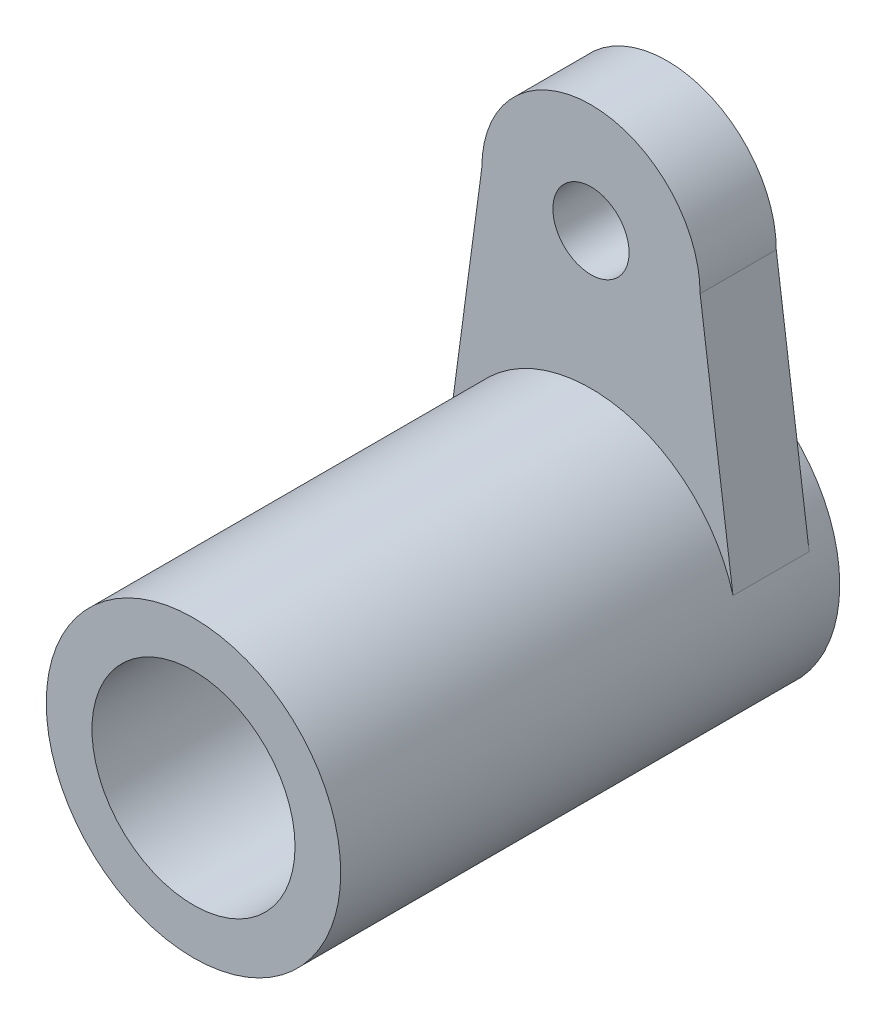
ISO-10303-21;
HEADER;
FILE_DESCRIPTION(('STEP AP214'),'2;1');
FILE_NAME('part.step','',(''),(''),'','','');
FILE_SCHEMA(('AUTOMOTIVE_DESIGN { 1 0 10303 214 1 1 1 1 }'));
ENDSEC;
DATA;
#1=APPLICATION_CONTEXT('core data for automotive mechanical design processes');
#2=APPLICATION_PROTOCOL_DEFINITION('international standard','automotive_design',2000,#1);
#3=PRODUCT_CONTEXT('',#1,'mechanical');
#4=PRODUCT('Part','Part','',(#3));
#5=PRODUCT_RELATED_PRODUCT_CATEGORY('part','',(#4));
#6=PRODUCT_DEFINITION_FORMATION('','',#4);
#7=PRODUCT_DEFINITION_CONTEXT('part definition',#1,'design');
#8=PRODUCT_DEFINITION('design','',#6,#7);
#9=PRODUCT_DEFINITION_SHAPE('','',#8);
#10=(LENGTH_UNIT() NAMED_UNIT(*) SI_UNIT(.MILLI.,.METRE.));
#11=(NAMED_UNIT(*) PLANE_ANGLE_UNIT() SI_UNIT($,.RADIAN.));
#12=(NAMED_UNIT(*) SI_UNIT($,.STERADIAN.) SOLID_ANGLE_UNIT());
#13=UNCERTAINTY_MEASURE_WITH_UNIT(LENGTH_MEASURE(1.E-05),#10,'distance_accuracy_value','');
#14=(GEOMETRIC_REPRESENTATION_CONTEXT(3) GLOBAL_UNCERTAINTY_ASSIGNED_CONTEXT((#13)) GLOBAL_UNIT_ASSIGNED_CONTEXT((#10,
#11,#12)) REPRESENTATION_CONTEXT('',''));
#15=CARTESIAN_POINT('',(0.,0.,0.));
#16=DIRECTION('',(0.,0.,1.));
#17=DIRECTION('',(1.,0.,0.));
#18=AXIS2_PLACEMENT_3D('',#15,#16,#17);
#19=CARTESIAN_POINT('',(0.,-5.59,0.));
#20=DIRECTION('',(0.,0.,1.));
#21=DIRECTION('',(1.,0.,0.));
#22=AXIS2_PLACEMENT_3D('',#19,#20,#21);
#23=PLANE('',#22);
#24=CARTESIAN_POINT('',(0.,0.,0.));
#25=DIRECTION('',(0.,0.,1.));
#26=DIRECTION('',(1.,0.,0.));
#27=AXIS2_PLACEMENT_3D('',#24,#25,#26);
#28=CIRCLE('',#27,0.75);
#29=CARTESIAN_POINT('',(0.75,0.,0.));
#30=VERTEX_POINT('',#29);
#31=EDGE_CURVE('E135',#30,#30,#28,.T.);
#32=ORIENTED_EDGE('',*,*,#31,.T.);
#33=EDGE_LOOP('',(#32));
#34=FACE_BOUND('',#33,.T.);
#35=CARTESIAN_POINT('',(0.,-5.59,0.));
#36=DIRECTION('',(0.,0.,-1.));
#37=DIRECTION('',(-1.,0.,0.));
#38=AXIS2_PLACEMENT_3D('',#35,#36,#37);
#39=CIRCLE('',#38,2.9);
#40=CARTESIAN_POINT('',(-2.79743984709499,-4.82558499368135,0.));
#41=VERTEX_POINT('',#40);
#42=CARTESIAN_POINT('',(2.79743984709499,-4.82558499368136,0.));
#43=VERTEX_POINT('',#42);
#44=EDGE_CURVE('E93',#41,#43,#39,.T.);
#45=ORIENTED_EDGE('',*,*,#44,.F.);
#46=DIRECTION('',(-0.132976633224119,-0.991119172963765,0.));
#47=VECTOR('',#46,1.);
#48=CARTESIAN_POINT('',(-2.15,0.,0.));
#49=LINE('',#48,#47);
#50=CARTESIAN_POINT('',(-2.15,0.,0.));
#51=VERTEX_POINT('',#50);
#52=EDGE_CURVE('E95',#51,#41,#49,.T.);
#53=ORIENTED_EDGE('',*,*,#52,.F.);
#54=CARTESIAN_POINT('',(0.,0.,0.));
#55=DIRECTION('',(0.,0.,1.));
#56=DIRECTION('',(1.,0.,0.));
#57=AXIS2_PLACEMENT_3D('',#54,#55,#56);
#58=CIRCLE('',#57,2.15);
#59=CARTESIAN_POINT('',(2.15,0.,0.));
#60=VERTEX_POINT('',#59);
#61=EDGE_CURVE('E81',#60,#51,#58,.T.);
#62=ORIENTED_EDGE('',*,*,#61,.F.);
#63=DIRECTION('',(-0.132976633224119,0.991119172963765,0.));
#64=VECTOR('',#63,1.);
#65=CARTESIAN_POINT('',(2.15,0.,0.));
#66=LINE('',#65,#64);
#67=EDGE_CURVE('E75',#43,#60,#66,.T.);
#68=ORIENTED_EDGE('',*,*,#67,.F.);
#69=EDGE_LOOP('',(#45,#53,#62,#68));
#70=FACE_BOUND('',#69,.T.);
#71=ADVANCED_FACE('F43',(#34,#70),#23,.F.);
#72=CARTESIAN_POINT('',(0.,-5.59,1.5));
#73=DIRECTION('',(0.,0.,-1.));
#74=DIRECTION('',(-1.,0.,0.));
#75=AXIS2_PLACEMENT_3D('',#72,#73,#74);
#76=CYLINDRICAL_SURFACE('',#75,2.9);
#77=DIRECTION('',(0.,0.,-1.));
#78=VECTOR('',#77,1.);
#79=CARTESIAN_POINT('',(-2.79743984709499,-4.82558499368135,1.5));
#80=LINE('',#79,#78);
#81=CARTESIAN_POINT('',(-2.79743984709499,-4.82558499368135,1.5));
#82=VERTEX_POINT('',#81);
#83=EDGE_CURVE('E103',#82,#41,#80,.T.);
#84=ORIENTED_EDGE('',*,*,#83,.T.);
#85=ORIENTED_EDGE('',*,*,#44,.T.);
#86=DIRECTION('',(0.,0.,-1.));
#87=VECTOR('',#86,1.);
#88=CARTESIAN_POINT('',(2.79743984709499,-4.82558499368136,1.5));
#89=LINE('',#88,#87);
#90=CARTESIAN_POINT('',(2.79743984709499,-4.82558499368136,1.5));
#91=VERTEX_POINT('',#90);
#92=EDGE_CURVE('E11',#91,#43,#89,.T.);
#93=ORIENTED_EDGE('',*,*,#92,.F.);
#94=CARTESIAN_POINT('',(0.,-5.59,1.5));
#95=DIRECTION('',(0.,0.,1.));
#96=DIRECTION('',(1.,0.,0.));
#97=AXIS2_PLACEMENT_3D('',#94,#95,#96);
#98=CIRCLE('',#97,2.9);
#99=EDGE_CURVE('E108',#91,#82,#98,.T.);
#100=ORIENTED_EDGE('',*,*,#99,.T.);
#101=EDGE_LOOP('',(#84,#85,#93,#100));
#102=FACE_BOUND('',#101,.T.);
#103=CARTESIAN_POINT('',(0.,-5.59,-0.5));
#104=DIRECTION('',(0.,0.,-1.));
#105=DIRECTION('',(-1.,0.,0.));
#106=AXIS2_PLACEMENT_3D('',#103,#104,#105);
#107=CIRCLE('',#106,2.9);
#108=CARTESIAN_POINT('',(-2.9,-5.59,-0.5));
#109=VERTEX_POINT('',#108);
#110=EDGE_CURVE('E98',#109,#109,#107,.T.);
#111=ORIENTED_EDGE('',*,*,#110,.F.);
#112=EDGE_LOOP('',(#111));
#113=FACE_BOUND('',#112,.T.);
#114=CARTESIAN_POINT('',(0.,-5.59,9.329));
#115=DIRECTION('',(0.,0.,1.));
#116=DIRECTION('',(1.,0.,0.));
#117=AXIS2_PLACEMENT_3D('',#114,#115,#116);
#118=CIRCLE('',#117,2.9);
#119=CARTESIAN_POINT('',(2.9,-5.59,9.329));
#120=VERTEX_POINT('',#119);
#121=EDGE_CURVE('E141',#120,#120,#118,.T.);
#122=ORIENTED_EDGE('',*,*,#121,.F.);
#123=EDGE_LOOP('',(#122));
#124=FACE_BOUND('',#123,.T.);
#125=ADVANCED_FACE('F45',(#102,#113,#124),#76,.T.);
#126=CARTESIAN_POINT('',(2.15,0.,1.5));
#127=DIRECTION('',(-0.991119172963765,-0.132976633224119,0.));
#128=DIRECTION('',(0.132976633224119,-0.991119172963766,0.));
#129=AXIS2_PLACEMENT_3D('',#126,#127,#128);
#130=PLANE('',#129);
#131=ORIENTED_EDGE('',*,*,#67,.T.);
#132=DIRECTION('',(0.,0.,-1.));
#133=VECTOR('',#132,1.);
#134=CARTESIAN_POINT('',(2.15,0.,1.5));
#135=LINE('',#134,#133);
#136=CARTESIAN_POINT('',(2.15,0.,1.5));
#137=VERTEX_POINT('',#136);
#138=EDGE_CURVE('E53',#137,#60,#135,.T.);
#139=ORIENTED_EDGE('',*,*,#138,.F.);
#140=DIRECTION('',(-0.132976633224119,0.991119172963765,0.));
#141=VECTOR('',#140,1.);
#142=CARTESIAN_POINT('',(2.15,0.,1.5));
#143=LINE('',#142,#141);
#144=EDGE_CURVE('E85',#91,#137,#143,.T.);
#145=ORIENTED_EDGE('',*,*,#144,.F.);
#146=ORIENTED_EDGE('',*,*,#92,.T.);
#147=EDGE_LOOP('',(#131,#139,#145,#146));
#148=FACE_BOUND('',#147,.T.);
#149=ADVANCED_FACE('F170',(#148),#130,.F.);
#150=CARTESIAN_POINT('',(0.,0.,1.5));
#151=DIRECTION('',(0.,0.,-1.));
#152=DIRECTION('',(-1.,0.,0.));
#153=AXIS2_PLACEMENT_3D('',#150,#151,#152);
#154=CYLINDRICAL_SURFACE('',#153,2.15);
#155=ORIENTED_EDGE('',*,*,#61,.T.);
#156=DIRECTION('',(0.,0.,-1.));
#157=VECTOR('',#156,1.);
#158=CARTESIAN_POINT('',(-2.15,0.,1.5));
#159=LINE('',#158,#157);
#160=CARTESIAN_POINT('',(-2.15,0.,1.5));
#161=VERTEX_POINT('',#160);
#162=EDGE_CURVE('E105',#161,#51,#159,.T.);
#163=ORIENTED_EDGE('',*,*,#162,.F.);
#164=CARTESIAN_POINT('',(0.,0.,1.5));
#165=DIRECTION('',(0.,0.,1.));
#166=DIRECTION('',(1.,0.,0.));
#167=AXIS2_PLACEMENT_3D('',#164,#165,#166);
#168=CIRCLE('',#167,2.15);
#169=EDGE_CURVE('E111',#137,#161,#168,.T.);
#170=ORIENTED_EDGE('',*,*,#169,.F.);
#171=ORIENTED_EDGE('',*,*,#138,.T.);
#172=EDGE_LOOP('',(#155,#163,#170,#171));
#173=FACE_BOUND('',#172,.T.);
#174=ADVANCED_FACE('F116',(#173),#154,.T.);
#175=CARTESIAN_POINT('',(-2.15,0.,1.5));
#176=DIRECTION('',(0.991119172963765,-0.132976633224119,0.));
#177=DIRECTION('',(0.132976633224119,0.991119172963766,0.));
#178=AXIS2_PLACEMENT_3D('',#175,#176,#177);
#179=PLANE('',#178);
#180=ORIENTED_EDGE('',*,*,#52,.T.);
#181=ORIENTED_EDGE('',*,*,#83,.F.);
#182=DIRECTION('',(-0.132976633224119,-0.991119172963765,0.));
#183=VECTOR('',#182,1.);
#184=CARTESIAN_POINT('',(-2.15,0.,1.5));
#185=LINE('',#184,#183);
#186=EDGE_CURVE('E61',#161,#82,#185,.T.);
#187=ORIENTED_EDGE('',*,*,#186,.F.);
#188=ORIENTED_EDGE('',*,*,#162,.T.);
#189=EDGE_LOOP('',(#180,#181,#187,#188));
#190=FACE_BOUND('',#189,.T.);
#191=ADVANCED_FACE('F102',(#190),#179,.F.);
#192=CARTESIAN_POINT('',(0.,-5.59,1.5));
#193=DIRECTION('',(0.,0.,1.));
#194=DIRECTION('',(1.,0.,0.));
#195=AXIS2_PLACEMENT_3D('',#192,#193,#194);
#196=PLANE('',#195);
#197=CARTESIAN_POINT('',(0.,0.,1.5));
#198=DIRECTION('',(0.,0.,1.));
#199=DIRECTION('',(1.,0.,0.));
#200=AXIS2_PLACEMENT_3D('',#197,#198,#199);
#201=CIRCLE('',#200,0.75);
#202=CARTESIAN_POINT('',(0.75,0.,1.5));
#203=VERTEX_POINT('',#202);
#204=EDGE_CURVE('E138',#203,#203,#201,.T.);
#205=ORIENTED_EDGE('',*,*,#204,.F.);
#206=EDGE_LOOP('',(#205));
#207=FACE_BOUND('',#206,.T.);
#208=ORIENTED_EDGE('',*,*,#99,.F.);
#209=ORIENTED_EDGE('',*,*,#144,.T.);
#210=ORIENTED_EDGE('',*,*,#169,.T.);
#211=ORIENTED_EDGE('',*,*,#186,.T.);
#212=EDGE_LOOP('',(#208,#209,#210,#211));
#213=FACE_BOUND('',#212,.T.);
#214=ADVANCED_FACE('F173',(#207,#213),#196,.T.);
#215=CARTESIAN_POINT('',(0.,-5.59,-0.5));
#216=DIRECTION('',(0.,0.,-1.));
#217=DIRECTION('',(-1.,0.,0.));
#218=AXIS2_PLACEMENT_3D('',#215,#216,#217);
#219=PLANE('',#218);
#220=CARTESIAN_POINT('',(0.,-5.59,-0.5));
#221=DIRECTION('',(0.,0.,-1.));
#222=DIRECTION('',(-1.,0.,0.));
#223=AXIS2_PLACEMENT_3D('',#220,#221,#222);
#224=CIRCLE('',#223,2.);
#225=CARTESIAN_POINT('',(-2.,-5.59,-0.5));
#226=VERTEX_POINT('',#225);
#227=EDGE_CURVE('E127',#226,#226,#224,.T.);
#228=ORIENTED_EDGE('',*,*,#227,.F.);
#229=EDGE_LOOP('',(#228));
#230=FACE_BOUND('',#229,.T.);
#231=ORIENTED_EDGE('',*,*,#110,.T.);
#232=EDGE_LOOP('',(#231));
#233=FACE_BOUND('',#232,.T.);
#234=ADVANCED_FACE('F194',(#230,#233),#219,.T.);
#235=CARTESIAN_POINT('',(0.,-5.59,2.329));
#236=DIRECTION('',(0.,0.,1.));
#237=DIRECTION('',(1.,0.,0.));
#238=AXIS2_PLACEMENT_3D('',#235,#236,#237);
#239=CYLINDRICAL_SURFACE('',#238,2.);
#240=CARTESIAN_POINT('',(0.,-5.59,2.329));
#241=DIRECTION('',(0.,0.,1.));
#242=DIRECTION('',(1.,0.,0.));
#243=AXIS2_PLACEMENT_3D('',#240,#241,#242);
#244=CIRCLE('',#243,2.);
#245=CARTESIAN_POINT('',(2.,-5.59,2.329));
#246=VERTEX_POINT('',#245);
#247=EDGE_CURVE('E99',#246,#246,#244,.T.);
#248=ORIENTED_EDGE('',*,*,#247,.F.);
#249=EDGE_LOOP('',(#248));
#250=FACE_BOUND('',#249,.T.);
#251=CARTESIAN_POINT('',(0.,-5.59,9.329));
#252=DIRECTION('',(0.,0.,1.));
#253=DIRECTION('',(1.,0.,0.));
#254=AXIS2_PLACEMENT_3D('',#251,#252,#253);
#255=CIRCLE('',#254,2.);
#256=CARTESIAN_POINT('',(2.,-5.59,9.329));
#257=VERTEX_POINT('',#256);
#258=EDGE_CURVE('E144',#257,#257,#255,.T.);
#259=ORIENTED_EDGE('',*,*,#258,.T.);
#260=EDGE_LOOP('',(#259));
#261=FACE_BOUND('',#260,.T.);
#262=ADVANCED_FACE('F148',(#250,#261),#239,.F.);
#263=CARTESIAN_POINT('',(0.,-5.59,2.329));
#264=DIRECTION('',(0.,0.,1.));
#265=DIRECTION('',(1.,0.,0.));
#266=AXIS2_PLACEMENT_3D('',#263,#264,#265);
#267=PLANE('',#266);
#268=CARTESIAN_POINT('',(0.,-5.59,2.329));
#269=DIRECTION('',(0.,0.,1.));
#270=DIRECTION('',(1.,0.,0.));
#271=AXIS2_PLACEMENT_3D('',#268,#269,#270);
#272=CIRCLE('',#271,1.1);
#273=CARTESIAN_POINT('',(1.1,-5.59,2.329));
#274=VERTEX_POINT('',#273);
#275=EDGE_CURVE('E47',#274,#274,#272,.T.);
#276=ORIENTED_EDGE('',*,*,#275,.F.);
#277=EDGE_LOOP('',(#276));
#278=FACE_BOUND('',#277,.T.);
#279=ORIENTED_EDGE('',*,*,#247,.T.);
#280=EDGE_LOOP('',(#279));
#281=FACE_BOUND('',#280,.T.);
#282=ADVANCED_FACE('F209',(#278,#281),#267,.T.);
#283=CARTESIAN_POINT('',(0.,-5.59,0.2));
#284=DIRECTION('',(0.,0.,-1.));
#285=DIRECTION('',(-1.,0.,0.));
#286=AXIS2_PLACEMENT_3D('',#283,#284,#285);
#287=CYLINDRICAL_SURFACE('',#286,2.);
#288=CARTESIAN_POINT('',(0.,-5.59,0.2));
#289=DIRECTION('',(0.,0.,-1.));
#290=DIRECTION('',(-1.,0.,0.));
#291=AXIS2_PLACEMENT_3D('',#288,#289,#290);
#292=CIRCLE('',#291,2.);
#293=CARTESIAN_POINT('',(-2.,-5.59,0.2));
#294=VERTEX_POINT('',#293);
#295=EDGE_CURVE('E126',#294,#294,#292,.T.);
#296=ORIENTED_EDGE('',*,*,#295,.F.);
#297=EDGE_LOOP('',(#296));
#298=FACE_BOUND('',#297,.T.);
#299=ORIENTED_EDGE('',*,*,#227,.T.);
#300=EDGE_LOOP('',(#299));
#301=FACE_BOUND('',#300,.T.);
#302=ADVANCED_FACE('F204',(#298,#301),#287,.F.);
#303=CARTESIAN_POINT('',(0.,-5.59,0.2));
#304=DIRECTION('',(0.,0.,-1.));
#305=DIRECTION('',(-1.,0.,0.));
#306=AXIS2_PLACEMENT_3D('',#303,#304,#305);
#307=PLANE('',#306);
#308=CARTESIAN_POINT('',(0.,-5.59,0.2));
#309=DIRECTION('',(0.,0.,-1.));
#310=DIRECTION('',(-1.,0.,0.));
#311=AXIS2_PLACEMENT_3D('',#308,#309,#310);
#312=CIRCLE('',#311,1.1);
#313=CARTESIAN_POINT('',(-1.1,-5.59,0.2));
#314=VERTEX_POINT('',#313);
#315=EDGE_CURVE('E132',#314,#314,#312,.T.);
#316=ORIENTED_EDGE('',*,*,#315,.F.);
#317=EDGE_LOOP('',(#316));
#318=FACE_BOUND('',#317,.T.);
#319=ORIENTED_EDGE('',*,*,#295,.T.);
#320=EDGE_LOOP('',(#319));
#321=FACE_BOUND('',#320,.T.);
#322=ADVANCED_FACE('F208',(#318,#321),#307,.T.);
#323=CARTESIAN_POINT('',(0.,-5.59,3.9));
#324=DIRECTION('',(0.,0.,-1.));
#325=DIRECTION('',(-1.,0.,0.));
#326=AXIS2_PLACEMENT_3D('',#323,#324,#325);
#327=CYLINDRICAL_SURFACE('',#326,1.1);
#328=ORIENTED_EDGE('',*,*,#275,.T.);
#329=EDGE_LOOP('',(#328));
#330=FACE_BOUND('',#329,.T.);
#331=ORIENTED_EDGE('',*,*,#315,.T.);
#332=EDGE_LOOP('',(#331));
#333=FACE_BOUND('',#332,.T.);
#334=ADVANCED_FACE('F159',(#330,#333),#327,.F.);
#335=CARTESIAN_POINT('',(0.,0.,-2.2));
#336=DIRECTION('',(0.,0.,1.));
#337=DIRECTION('',(1.,0.,0.));
#338=AXIS2_PLACEMENT_3D('',#335,#336,#337);
#339=CYLINDRICAL_SURFACE('',#338,0.75);
#340=ORIENTED_EDGE('',*,*,#204,.T.);
#341=EDGE_LOOP('',(#340));
#342=FACE_BOUND('',#341,.T.);
#343=ORIENTED_EDGE('',*,*,#31,.F.);
#344=EDGE_LOOP('',(#343));
#345=FACE_BOUND('',#344,.T.);
#346=ADVANCED_FACE('F152',(#342,#345),#339,.F.);
#347=CARTESIAN_POINT('',(0.,-5.59,9.329));
#348=DIRECTION('',(0.,0.,1.));
#349=DIRECTION('',(1.,0.,0.));
#350=AXIS2_PLACEMENT_3D('',#347,#348,#349);
#351=PLANE('',#350);
#352=ORIENTED_EDGE('',*,*,#121,.T.);
#353=EDGE_LOOP('',(#352));
#354=FACE_BOUND('',#353,.T.);
#355=ORIENTED_EDGE('',*,*,#258,.F.);
#356=EDGE_LOOP('',(#355));
#357=FACE_BOUND('',#356,.T.);
#358=ADVANCED_FACE('F150',(#354,#357),#351,.T.);
#359=CLOSED_SHELL('',(#71,#125,#149,#174,#191,#214,#234,#262,#282,#302,#322,#334,#346,#358));
#360=MANIFOLD_SOLID_BREP('B2',#359);
#361=ADVANCED_BREP_SHAPE_REPRESENTATION('',(#18,#360),#14);
#362=SHAPE_DEFINITION_REPRESENTATION(#9,#361);
ENDSEC;
END-ISO-10303-21;
